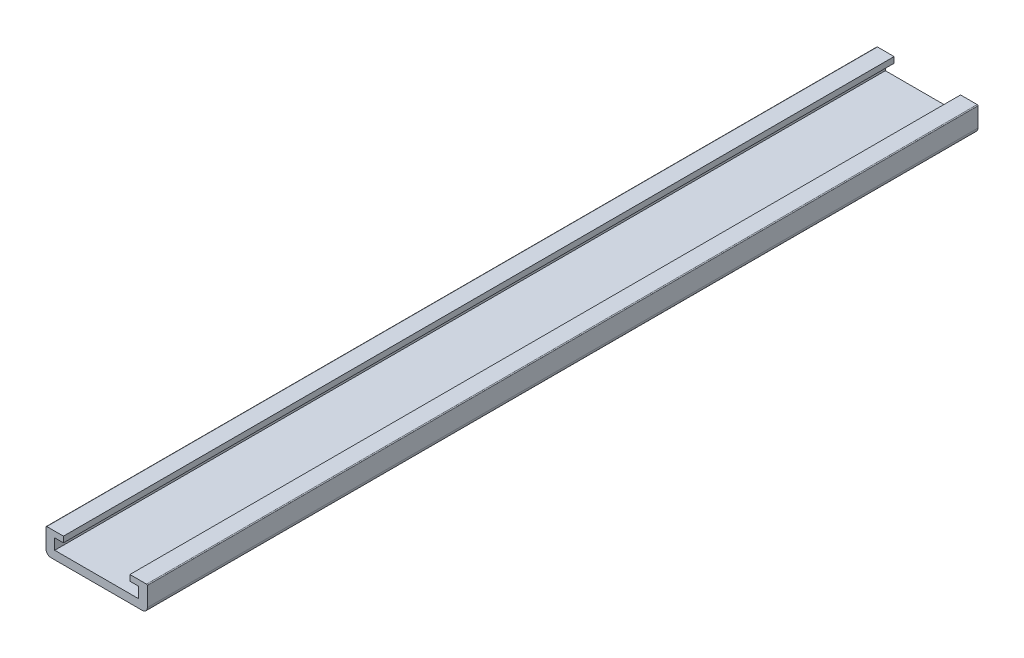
ISO-10303-21;
HEADER;
FILE_DESCRIPTION(('STEP AP214'),'2;1');
FILE_NAME('part.step','',(''),(''),'','','');
FILE_SCHEMA(('AUTOMOTIVE_DESIGN { 1 0 10303 214 1 1 1 1 }'));
ENDSEC;
DATA;
#1=APPLICATION_CONTEXT('core data for automotive mechanical design processes');
#2=APPLICATION_PROTOCOL_DEFINITION('international standard','automotive_design',2000,#1);
#3=PRODUCT_CONTEXT('',#1,'mechanical');
#4=PRODUCT('Part','Part','',(#3));
#5=PRODUCT_RELATED_PRODUCT_CATEGORY('part','',(#4));
#6=PRODUCT_DEFINITION_FORMATION('','',#4);
#7=PRODUCT_DEFINITION_CONTEXT('part definition',#1,'design');
#8=PRODUCT_DEFINITION('design','',#6,#7);
#9=PRODUCT_DEFINITION_SHAPE('','',#8);
#10=(LENGTH_UNIT() NAMED_UNIT(*) SI_UNIT(.MILLI.,.METRE.));
#11=(NAMED_UNIT(*) PLANE_ANGLE_UNIT() SI_UNIT($,.RADIAN.));
#12=(NAMED_UNIT(*) SI_UNIT($,.STERADIAN.) SOLID_ANGLE_UNIT());
#13=UNCERTAINTY_MEASURE_WITH_UNIT(LENGTH_MEASURE(1.E-05),#10,'distance_accuracy_value','');
#14=(GEOMETRIC_REPRESENTATION_CONTEXT(3) GLOBAL_UNCERTAINTY_ASSIGNED_CONTEXT((#13)) GLOBAL_UNIT_ASSIGNED_CONTEXT((#10,
#11,#12)) REPRESENTATION_CONTEXT('',''));
#15=CARTESIAN_POINT('',(0.,0.,0.));
#16=DIRECTION('',(0.,0.,1.));
#17=DIRECTION('',(1.,0.,0.));
#18=AXIS2_PLACEMENT_3D('',#15,#16,#17);
#19=CARTESIAN_POINT('',(-25.25,4.50872170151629,500.));
#20=DIRECTION('',(-1.,0.,0.));
#21=DIRECTION('',(0.,0.,1.));
#22=AXIS2_PLACEMENT_3D('',#19,#20,#21);
#23=PLANE('',#22);
#24=DIRECTION('',(0.,1.,0.));
#25=VECTOR('',#24,1.);
#26=CARTESIAN_POINT('',(-25.25,4.50872170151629,0.));
#27=LINE('',#26,#25);
#28=CARTESIAN_POINT('',(-25.25,4.50872170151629,0.));
#29=VERTEX_POINT('',#28);
#30=CARTESIAN_POINT('',(-25.25,11.0087217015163,0.));
#31=VERTEX_POINT('',#30);
#32=EDGE_CURVE('E158',#29,#31,#27,.T.);
#33=ORIENTED_EDGE('',*,*,#32,.T.);
#34=DIRECTION('',(0.,0.,-1.));
#35=VECTOR('',#34,1.);
#36=CARTESIAN_POINT('',(-25.25,11.0087217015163,500.));
#37=LINE('',#36,#35);
#38=CARTESIAN_POINT('',(-25.25,11.0087217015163,500.));
#39=VERTEX_POINT('',#38);
#40=EDGE_CURVE('E9',#39,#31,#37,.T.);
#41=ORIENTED_EDGE('',*,*,#40,.F.);
#42=DIRECTION('',(0.,1.,0.));
#43=VECTOR('',#42,1.);
#44=CARTESIAN_POINT('',(-25.25,4.50872170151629,500.));
#45=LINE('',#44,#43);
#46=CARTESIAN_POINT('',(-25.25,4.50872170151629,500.));
#47=VERTEX_POINT('',#46);
#48=EDGE_CURVE('E188',#47,#39,#45,.T.);
#49=ORIENTED_EDGE('',*,*,#48,.F.);
#50=DIRECTION('',(0.,0.,-1.));
#51=VECTOR('',#50,1.);
#52=CARTESIAN_POINT('',(-25.25,4.50872170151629,500.));
#53=LINE('',#52,#51);
#54=EDGE_CURVE('E154',#47,#29,#53,.T.);
#55=ORIENTED_EDGE('',*,*,#54,.T.);
#56=EDGE_LOOP('',(#33,#41,#49,#55));
#57=FACE_BOUND('',#56,.T.);
#58=ADVANCED_FACE('F14',(#57),#23,.F.);
#59=CARTESIAN_POINT('',(-25.25,11.0087217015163,500.));
#60=DIRECTION('',(0.,1.,0.));
#61=DIRECTION('',(0.,0.,1.));
#62=AXIS2_PLACEMENT_3D('',#59,#60,#61);
#63=PLANE('',#62);
#64=DIRECTION('',(1.,0.,0.));
#65=VECTOR('',#64,1.);
#66=CARTESIAN_POINT('',(-25.25,11.0087217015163,0.));
#67=LINE('',#66,#65);
#68=CARTESIAN_POINT('',(-20.,11.0087217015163,0.));
#69=VERTEX_POINT('',#68);
#70=EDGE_CURVE('E161',#31,#69,#67,.T.);
#71=ORIENTED_EDGE('',*,*,#70,.T.);
#72=DIRECTION('',(0.,0.,-1.));
#73=VECTOR('',#72,1.);
#74=CARTESIAN_POINT('',(-20.,11.0087217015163,500.));
#75=LINE('',#74,#73);
#76=CARTESIAN_POINT('',(-20.,11.0087217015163,500.));
#77=VERTEX_POINT('',#76);
#78=EDGE_CURVE('E22',#77,#69,#75,.T.);
#79=ORIENTED_EDGE('',*,*,#78,.F.);
#80=DIRECTION('',(1.,0.,0.));
#81=VECTOR('',#80,1.);
#82=CARTESIAN_POINT('',(-25.25,11.0087217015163,500.));
#83=LINE('',#82,#81);
#84=EDGE_CURVE('E97',#39,#77,#83,.T.);
#85=ORIENTED_EDGE('',*,*,#84,.F.);
#86=ORIENTED_EDGE('',*,*,#40,.T.);
#87=EDGE_LOOP('',(#71,#79,#85,#86));
#88=FACE_BOUND('',#87,.T.);
#89=ADVANCED_FACE('F287',(#88),#63,.F.);
#90=CARTESIAN_POINT('',(-20.,14.5087217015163,500.));
#91=DIRECTION('',(-1.,0.,0.));
#92=DIRECTION('',(0.,0.,1.));
#93=AXIS2_PLACEMENT_3D('',#90,#91,#92);
#94=PLANE('',#93);
#95=DIRECTION('',(0.,1.,0.));
#96=VECTOR('',#95,1.);
#97=CARTESIAN_POINT('',(-20.,14.5087217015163,0.));
#98=LINE('',#97,#96);
#99=CARTESIAN_POINT('',(-20.,14.5087217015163,0.));
#100=VERTEX_POINT('',#99);
#101=EDGE_CURVE('E163',#69,#100,#98,.T.);
#102=ORIENTED_EDGE('',*,*,#101,.T.);
#103=DIRECTION('',(0.,0.,-1.));
#104=VECTOR('',#103,1.);
#105=CARTESIAN_POINT('',(-20.,14.5087217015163,500.));
#106=LINE('',#105,#104);
#107=CARTESIAN_POINT('',(-20.,14.5087217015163,500.));
#108=VERTEX_POINT('',#107);
#109=EDGE_CURVE('E219',#108,#100,#106,.T.);
#110=ORIENTED_EDGE('',*,*,#109,.F.);
#111=DIRECTION('',(0.,1.,0.));
#112=VECTOR('',#111,1.);
#113=CARTESIAN_POINT('',(-20.,14.5087217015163,500.));
#114=LINE('',#113,#112);
#115=EDGE_CURVE('E227',#77,#108,#114,.T.);
#116=ORIENTED_EDGE('',*,*,#115,.F.);
#117=ORIENTED_EDGE('',*,*,#78,.T.);
#118=EDGE_LOOP('',(#102,#110,#116,#117));
#119=FACE_BOUND('',#118,.T.);
#120=ADVANCED_FACE('F225',(#119),#94,.F.);
#121=CARTESIAN_POINT('',(-30.,14.5087217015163,500.));
#122=DIRECTION('',(0.,-1.,0.));
#123=DIRECTION('',(0.,0.,-1.));
#124=AXIS2_PLACEMENT_3D('',#121,#122,#123);
#125=PLANE('',#124);
#126=DIRECTION('',(-1.,0.,0.));
#127=VECTOR('',#126,1.);
#128=CARTESIAN_POINT('',(-30.,14.5087217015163,0.));
#129=LINE('',#128,#127);
#130=CARTESIAN_POINT('',(-30.,14.5087217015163,0.));
#131=VERTEX_POINT('',#130);
#132=EDGE_CURVE('E165',#100,#131,#129,.T.);
#133=ORIENTED_EDGE('',*,*,#132,.T.);
#134=DIRECTION('',(0.,0.,-1.));
#135=VECTOR('',#134,1.);
#136=CARTESIAN_POINT('',(-30.,14.5087217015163,500.));
#137=LINE('',#136,#135);
#138=CARTESIAN_POINT('',(-30.,14.5087217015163,500.));
#139=VERTEX_POINT('',#138);
#140=EDGE_CURVE('E216',#139,#131,#137,.T.);
#141=ORIENTED_EDGE('',*,*,#140,.F.);
#142=DIRECTION('',(-1.,0.,0.));
#143=VECTOR('',#142,1.);
#144=CARTESIAN_POINT('',(-30.,14.5087217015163,500.));
#145=LINE('',#144,#143);
#146=EDGE_CURVE('E245',#108,#139,#145,.T.);
#147=ORIENTED_EDGE('',*,*,#146,.F.);
#148=ORIENTED_EDGE('',*,*,#109,.T.);
#149=EDGE_LOOP('',(#133,#141,#147,#148));
#150=FACE_BOUND('',#149,.T.);
#151=ADVANCED_FACE('F236',(#150),#125,.F.);
#152=CARTESIAN_POINT('',(-30.,14.0087217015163,500.));
#153=DIRECTION('',(0.,0.,-1.));
#154=DIRECTION('',(-1.,0.,0.));
#155=AXIS2_PLACEMENT_3D('',#152,#153,#154);
#156=CYLINDRICAL_SURFACE('',#155,0.5);
#157=CARTESIAN_POINT('',(-30.,14.0087217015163,0.));
#158=DIRECTION('',(0.,0.,1.));
#159=DIRECTION('',(-1.,0.,0.));
#160=AXIS2_PLACEMENT_3D('',#157,#158,#159);
#161=CIRCLE('',#160,0.5);
#162=CARTESIAN_POINT('',(-30.5,14.0087217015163,0.));
#163=VERTEX_POINT('',#162);
#164=EDGE_CURVE('E167',#131,#163,#161,.T.);
#165=ORIENTED_EDGE('',*,*,#164,.T.);
#166=DIRECTION('',(0.,0.,-1.));
#167=VECTOR('',#166,1.);
#168=CARTESIAN_POINT('',(-30.5,14.0087217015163,500.));
#169=LINE('',#168,#167);
#170=CARTESIAN_POINT('',(-30.5,14.0087217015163,500.));
#171=VERTEX_POINT('',#170);
#172=EDGE_CURVE('E213',#171,#163,#169,.T.);
#173=ORIENTED_EDGE('',*,*,#172,.F.);
#174=CARTESIAN_POINT('',(-30.,14.0087217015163,500.));
#175=DIRECTION('',(0.,0.,1.));
#176=DIRECTION('',(-1.,0.,0.));
#177=AXIS2_PLACEMENT_3D('',#174,#175,#176);
#178=CIRCLE('',#177,0.5);
#179=EDGE_CURVE('E242',#139,#171,#178,.T.);
#180=ORIENTED_EDGE('',*,*,#179,.F.);
#181=ORIENTED_EDGE('',*,*,#140,.T.);
#182=EDGE_LOOP('',(#165,#173,#180,#181));
#183=FACE_BOUND('',#182,.T.);
#184=ADVANCED_FACE('F240',(#183),#156,.T.);
#185=CARTESIAN_POINT('',(-30.5,2.50872170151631,500.));
#186=DIRECTION('',(1.,0.,0.));
#187=DIRECTION('',(0.,0.,-1.));
#188=AXIS2_PLACEMENT_3D('',#185,#186,#187);
#189=PLANE('',#188);
#190=DIRECTION('',(0.,-1.,0.));
#191=VECTOR('',#190,1.);
#192=CARTESIAN_POINT('',(-30.5,2.50872170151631,0.));
#193=LINE('',#192,#191);
#194=CARTESIAN_POINT('',(-30.5,2.50872170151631,0.));
#195=VERTEX_POINT('',#194);
#196=EDGE_CURVE('E169',#163,#195,#193,.T.);
#197=ORIENTED_EDGE('',*,*,#196,.T.);
#198=DIRECTION('',(0.,0.,-1.));
#199=VECTOR('',#198,1.);
#200=CARTESIAN_POINT('',(-30.5,2.50872170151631,500.));
#201=LINE('',#200,#199);
#202=CARTESIAN_POINT('',(-30.5,2.50872170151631,500.));
#203=VERTEX_POINT('',#202);
#204=EDGE_CURVE('E210',#203,#195,#201,.T.);
#205=ORIENTED_EDGE('',*,*,#204,.F.);
#206=DIRECTION('',(0.,-1.,0.));
#207=VECTOR('',#206,1.);
#208=CARTESIAN_POINT('',(-30.5,2.50872170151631,500.));
#209=LINE('',#208,#207);
#210=EDGE_CURVE('E244',#171,#203,#209,.T.);
#211=ORIENTED_EDGE('',*,*,#210,.F.);
#212=ORIENTED_EDGE('',*,*,#172,.T.);
#213=EDGE_LOOP('',(#197,#205,#211,#212));
#214=FACE_BOUND('',#213,.T.);
#215=ADVANCED_FACE('F300',(#214),#189,.F.);
#216=CARTESIAN_POINT('',(-27.5,2.50872170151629,500.));
#217=DIRECTION('',(0.,0.,-1.));
#218=DIRECTION('',(-1.,0.,0.));
#219=AXIS2_PLACEMENT_3D('',#216,#217,#218);
#220=CYLINDRICAL_SURFACE('',#219,3.);
#221=CARTESIAN_POINT('',(-27.5,2.50872170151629,0.));
#222=DIRECTION('',(0.,0.,1.));
#223=DIRECTION('',(1.,0.,0.));
#224=AXIS2_PLACEMENT_3D('',#221,#222,#223);
#225=CIRCLE('',#224,3.);
#226=CARTESIAN_POINT('',(-27.5,-0.491278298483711,0.));
#227=VERTEX_POINT('',#226);
#228=EDGE_CURVE('E171',#195,#227,#225,.T.);
#229=ORIENTED_EDGE('',*,*,#228,.T.);
#230=DIRECTION('',(0.,0.,-1.));
#231=VECTOR('',#230,1.);
#232=CARTESIAN_POINT('',(-27.5,-0.491278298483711,500.));
#233=LINE('',#232,#231);
#234=CARTESIAN_POINT('',(-27.5,-0.491278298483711,500.));
#235=VERTEX_POINT('',#234);
#236=EDGE_CURVE('E207',#235,#227,#233,.T.);
#237=ORIENTED_EDGE('',*,*,#236,.F.);
#238=CARTESIAN_POINT('',(-27.5,2.50872170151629,500.));
#239=DIRECTION('',(0.,0.,1.));
#240=DIRECTION('',(1.,0.,0.));
#241=AXIS2_PLACEMENT_3D('',#238,#239,#240);
#242=CIRCLE('',#241,3.);
#243=EDGE_CURVE('E247',#203,#235,#242,.T.);
#244=ORIENTED_EDGE('',*,*,#243,.F.);
#245=ORIENTED_EDGE('',*,*,#204,.T.);
#246=EDGE_LOOP('',(#229,#237,#244,#245));
#247=FACE_BOUND('',#246,.T.);
#248=ADVANCED_FACE('F303',(#247),#220,.T.);
#249=CARTESIAN_POINT('',(-27.5,-0.491278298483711,500.));
#250=DIRECTION('',(0.,1.,0.));
#251=DIRECTION('',(0.,0.,1.));
#252=AXIS2_PLACEMENT_3D('',#249,#250,#251);
#253=PLANE('',#252);
#254=DIRECTION('',(1.,0.,0.));
#255=VECTOR('',#254,1.);
#256=CARTESIAN_POINT('',(-27.5,-0.491278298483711,0.));
#257=LINE('',#256,#255);
#258=CARTESIAN_POINT('',(27.5,-0.491278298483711,0.));
#259=VERTEX_POINT('',#258);
#260=EDGE_CURVE('E173',#227,#259,#257,.T.);
#261=ORIENTED_EDGE('',*,*,#260,.T.);
#262=DIRECTION('',(0.,0.,-1.));
#263=VECTOR('',#262,1.);
#264=CARTESIAN_POINT('',(27.5,-0.491278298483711,500.));
#265=LINE('',#264,#263);
#266=CARTESIAN_POINT('',(27.5,-0.491278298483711,500.));
#267=VERTEX_POINT('',#266);
#268=EDGE_CURVE('E204',#267,#259,#265,.T.);
#269=ORIENTED_EDGE('',*,*,#268,.F.);
#270=DIRECTION('',(1.,0.,0.));
#271=VECTOR('',#270,1.);
#272=CARTESIAN_POINT('',(-27.5,-0.491278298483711,500.));
#273=LINE('',#272,#271);
#274=EDGE_CURVE('E253',#235,#267,#273,.T.);
#275=ORIENTED_EDGE('',*,*,#274,.F.);
#276=ORIENTED_EDGE('',*,*,#236,.T.);
#277=EDGE_LOOP('',(#261,#269,#275,#276));
#278=FACE_BOUND('',#277,.T.);
#279=ADVANCED_FACE('F307',(#278),#253,.F.);
#280=CARTESIAN_POINT('',(27.5,2.50872170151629,500.));
#281=DIRECTION('',(0.,0.,-1.));
#282=DIRECTION('',(-1.,0.,0.));
#283=AXIS2_PLACEMENT_3D('',#280,#281,#282);
#284=CYLINDRICAL_SURFACE('',#283,3.);
#285=CARTESIAN_POINT('',(27.5,2.50872170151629,0.));
#286=DIRECTION('',(0.,0.,1.));
#287=DIRECTION('',(-1.,0.,0.));
#288=AXIS2_PLACEMENT_3D('',#285,#286,#287);
#289=CIRCLE('',#288,3.);
#290=CARTESIAN_POINT('',(30.5,2.50872170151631,0.));
#291=VERTEX_POINT('',#290);
#292=EDGE_CURVE('E175',#259,#291,#289,.T.);
#293=ORIENTED_EDGE('',*,*,#292,.T.);
#294=DIRECTION('',(0.,0.,-1.));
#295=VECTOR('',#294,1.);
#296=CARTESIAN_POINT('',(30.5,2.50872170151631,500.));
#297=LINE('',#296,#295);
#298=CARTESIAN_POINT('',(30.5,2.50872170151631,500.));
#299=VERTEX_POINT('',#298);
#300=EDGE_CURVE('E201',#299,#291,#297,.T.);
#301=ORIENTED_EDGE('',*,*,#300,.F.);
#302=CARTESIAN_POINT('',(27.5,2.50872170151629,500.));
#303=DIRECTION('',(0.,0.,1.));
#304=DIRECTION('',(-1.,0.,0.));
#305=AXIS2_PLACEMENT_3D('',#302,#303,#304);
#306=CIRCLE('',#305,3.);
#307=EDGE_CURVE('E255',#267,#299,#306,.T.);
#308=ORIENTED_EDGE('',*,*,#307,.F.);
#309=ORIENTED_EDGE('',*,*,#268,.T.);
#310=EDGE_LOOP('',(#293,#301,#308,#309));
#311=FACE_BOUND('',#310,.T.);
#312=ADVANCED_FACE('F311',(#311),#284,.T.);
#313=CARTESIAN_POINT('',(30.5,2.50872170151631,500.));
#314=DIRECTION('',(-1.,0.,0.));
#315=DIRECTION('',(0.,-1.,0.));
#316=AXIS2_PLACEMENT_3D('',#313,#314,#315);
#317=PLANE('',#316);
#318=DIRECTION('',(0.,1.,0.));
#319=VECTOR('',#318,1.);
#320=CARTESIAN_POINT('',(30.5,2.50872170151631,0.));
#321=LINE('',#320,#319);
#322=CARTESIAN_POINT('',(30.5,14.0087217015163,0.));
#323=VERTEX_POINT('',#322);
#324=EDGE_CURVE('E177',#291,#323,#321,.T.);
#325=ORIENTED_EDGE('',*,*,#324,.T.);
#326=DIRECTION('',(0.,0.,-1.));
#327=VECTOR('',#326,1.);
#328=CARTESIAN_POINT('',(30.5,14.0087217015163,500.));
#329=LINE('',#328,#327);
#330=CARTESIAN_POINT('',(30.5,14.0087217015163,500.));
#331=VERTEX_POINT('',#330);
#332=EDGE_CURVE('E198',#331,#323,#329,.T.);
#333=ORIENTED_EDGE('',*,*,#332,.F.);
#334=DIRECTION('',(0.,1.,0.));
#335=VECTOR('',#334,1.);
#336=CARTESIAN_POINT('',(30.5,2.50872170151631,500.));
#337=LINE('',#336,#335);
#338=EDGE_CURVE('E257',#299,#331,#337,.T.);
#339=ORIENTED_EDGE('',*,*,#338,.F.);
#340=ORIENTED_EDGE('',*,*,#300,.T.);
#341=EDGE_LOOP('',(#325,#333,#339,#340));
#342=FACE_BOUND('',#341,.T.);
#343=ADVANCED_FACE('F315',(#342),#317,.F.);
#344=CARTESIAN_POINT('',(30.,14.0087217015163,500.));
#345=DIRECTION('',(0.,0.,-1.));
#346=DIRECTION('',(-1.,0.,0.));
#347=AXIS2_PLACEMENT_3D('',#344,#345,#346);
#348=CYLINDRICAL_SURFACE('',#347,0.5);
#349=CARTESIAN_POINT('',(30.,14.0087217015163,0.));
#350=DIRECTION('',(0.,0.,1.));
#351=DIRECTION('',(1.,0.,0.));
#352=AXIS2_PLACEMENT_3D('',#349,#350,#351);
#353=CIRCLE('',#352,0.5);
#354=CARTESIAN_POINT('',(30.,14.5087217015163,0.));
#355=VERTEX_POINT('',#354);
#356=EDGE_CURVE('E179',#323,#355,#353,.T.);
#357=ORIENTED_EDGE('',*,*,#356,.T.);
#358=DIRECTION('',(0.,0.,-1.));
#359=VECTOR('',#358,1.);
#360=CARTESIAN_POINT('',(30.,14.5087217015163,500.));
#361=LINE('',#360,#359);
#362=CARTESIAN_POINT('',(30.,14.5087217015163,500.));
#363=VERTEX_POINT('',#362);
#364=EDGE_CURVE('E195',#363,#355,#361,.T.);
#365=ORIENTED_EDGE('',*,*,#364,.F.);
#366=CARTESIAN_POINT('',(30.,14.0087217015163,500.));
#367=DIRECTION('',(0.,0.,1.));
#368=DIRECTION('',(1.,0.,0.));
#369=AXIS2_PLACEMENT_3D('',#366,#367,#368);
#370=CIRCLE('',#369,0.5);
#371=EDGE_CURVE('E259',#331,#363,#370,.T.);
#372=ORIENTED_EDGE('',*,*,#371,.F.);
#373=ORIENTED_EDGE('',*,*,#332,.T.);
#374=EDGE_LOOP('',(#357,#365,#372,#373));
#375=FACE_BOUND('',#374,.T.);
#376=ADVANCED_FACE('F319',(#375),#348,.T.);
#377=CARTESIAN_POINT('',(20.,14.5087217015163,500.));
#378=DIRECTION('',(0.,-1.,0.));
#379=DIRECTION('',(0.,0.,-1.));
#380=AXIS2_PLACEMENT_3D('',#377,#378,#379);
#381=PLANE('',#380);
#382=DIRECTION('',(-1.,0.,0.));
#383=VECTOR('',#382,1.);
#384=CARTESIAN_POINT('',(20.,14.5087217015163,0.));
#385=LINE('',#384,#383);
#386=CARTESIAN_POINT('',(20.,14.5087217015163,0.));
#387=VERTEX_POINT('',#386);
#388=EDGE_CURVE('E181',#355,#387,#385,.T.);
#389=ORIENTED_EDGE('',*,*,#388,.T.);
#390=DIRECTION('',(0.,0.,-1.));
#391=VECTOR('',#390,1.);
#392=CARTESIAN_POINT('',(20.,14.5087217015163,500.));
#393=LINE('',#392,#391);
#394=CARTESIAN_POINT('',(20.,14.5087217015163,500.));
#395=VERTEX_POINT('',#394);
#396=EDGE_CURVE('E192',#395,#387,#393,.T.);
#397=ORIENTED_EDGE('',*,*,#396,.F.);
#398=DIRECTION('',(-1.,0.,0.));
#399=VECTOR('',#398,1.);
#400=CARTESIAN_POINT('',(20.,14.5087217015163,500.));
#401=LINE('',#400,#399);
#402=EDGE_CURVE('E261',#363,#395,#401,.T.);
#403=ORIENTED_EDGE('',*,*,#402,.F.);
#404=ORIENTED_EDGE('',*,*,#364,.T.);
#405=EDGE_LOOP('',(#389,#397,#403,#404));
#406=FACE_BOUND('',#405,.T.);
#407=ADVANCED_FACE('F267',(#406),#381,.F.);
#408=CARTESIAN_POINT('',(20.,14.5087217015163,500.));
#409=DIRECTION('',(1.,0.,0.));
#410=DIRECTION('',(0.,0.,-1.));
#411=AXIS2_PLACEMENT_3D('',#408,#409,#410);
#412=PLANE('',#411);
#413=DIRECTION('',(0.,-1.,0.));
#414=VECTOR('',#413,1.);
#415=CARTESIAN_POINT('',(20.,14.5087217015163,0.));
#416=LINE('',#415,#414);
#417=CARTESIAN_POINT('',(20.,11.0087217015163,0.));
#418=VERTEX_POINT('',#417);
#419=EDGE_CURVE('E183',#387,#418,#416,.T.);
#420=ORIENTED_EDGE('',*,*,#419,.T.);
#421=DIRECTION('',(0.,0.,-1.));
#422=VECTOR('',#421,1.);
#423=CARTESIAN_POINT('',(20.,11.0087217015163,500.));
#424=LINE('',#423,#422);
#425=CARTESIAN_POINT('',(20.,11.0087217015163,500.));
#426=VERTEX_POINT('',#425);
#427=EDGE_CURVE('E149',#426,#418,#424,.T.);
#428=ORIENTED_EDGE('',*,*,#427,.F.);
#429=DIRECTION('',(0.,-1.,0.));
#430=VECTOR('',#429,1.);
#431=CARTESIAN_POINT('',(20.,14.5087217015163,500.));
#432=LINE('',#431,#430);
#433=EDGE_CURVE('E140',#395,#426,#432,.T.);
#434=ORIENTED_EDGE('',*,*,#433,.F.);
#435=ORIENTED_EDGE('',*,*,#396,.T.);
#436=EDGE_LOOP('',(#420,#428,#434,#435));
#437=FACE_BOUND('',#436,.T.);
#438=ADVANCED_FACE('F271',(#437),#412,.F.);
#439=CARTESIAN_POINT('',(20.,11.0087217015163,500.));
#440=DIRECTION('',(0.,1.,0.));
#441=DIRECTION('',(0.,0.,1.));
#442=AXIS2_PLACEMENT_3D('',#439,#440,#441);
#443=PLANE('',#442);
#444=DIRECTION('',(1.,0.,0.));
#445=VECTOR('',#444,1.);
#446=CARTESIAN_POINT('',(20.,11.0087217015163,0.));
#447=LINE('',#446,#445);
#448=CARTESIAN_POINT('',(25.25,11.0087217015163,0.));
#449=VERTEX_POINT('',#448);
#450=EDGE_CURVE('E148',#418,#449,#447,.T.);
#451=ORIENTED_EDGE('',*,*,#450,.T.);
#452=DIRECTION('',(0.,0.,-1.));
#453=VECTOR('',#452,1.);
#454=CARTESIAN_POINT('',(25.25,11.0087217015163,500.));
#455=LINE('',#454,#453);
#456=CARTESIAN_POINT('',(25.25,11.0087217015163,500.));
#457=VERTEX_POINT('',#456);
#458=EDGE_CURVE('E145',#457,#449,#455,.T.);
#459=ORIENTED_EDGE('',*,*,#458,.F.);
#460=DIRECTION('',(1.,0.,0.));
#461=VECTOR('',#460,1.);
#462=CARTESIAN_POINT('',(20.,11.0087217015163,500.));
#463=LINE('',#462,#461);
#464=EDGE_CURVE('E134',#426,#457,#463,.T.);
#465=ORIENTED_EDGE('',*,*,#464,.F.);
#466=ORIENTED_EDGE('',*,*,#427,.T.);
#467=EDGE_LOOP('',(#451,#459,#465,#466));
#468=FACE_BOUND('',#467,.T.);
#469=ADVANCED_FACE('F146',(#468),#443,.F.);
#470=CARTESIAN_POINT('',(25.25,4.50872170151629,500.));
#471=DIRECTION('',(1.,0.,0.));
#472=DIRECTION('',(0.,0.,-1.));
#473=AXIS2_PLACEMENT_3D('',#470,#471,#472);
#474=PLANE('',#473);
#475=DIRECTION('',(0.,-1.,0.));
#476=VECTOR('',#475,1.);
#477=CARTESIAN_POINT('',(25.25,4.50872170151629,0.));
#478=LINE('',#477,#476);
#479=CARTESIAN_POINT('',(25.25,4.50872170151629,0.));
#480=VERTEX_POINT('',#479);
#481=EDGE_CURVE('E83',#449,#480,#478,.T.);
#482=ORIENTED_EDGE('',*,*,#481,.T.);
#483=DIRECTION('',(0.,0.,-1.));
#484=VECTOR('',#483,1.);
#485=CARTESIAN_POINT('',(25.25,4.50872170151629,500.));
#486=LINE('',#485,#484);
#487=CARTESIAN_POINT('',(25.25,4.50872170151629,500.));
#488=VERTEX_POINT('',#487);
#489=EDGE_CURVE('E150',#488,#480,#486,.T.);
#490=ORIENTED_EDGE('',*,*,#489,.F.);
#491=DIRECTION('',(0.,-1.,0.));
#492=VECTOR('',#491,1.);
#493=CARTESIAN_POINT('',(25.25,4.50872170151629,500.));
#494=LINE('',#493,#492);
#495=EDGE_CURVE('E138',#457,#488,#494,.T.);
#496=ORIENTED_EDGE('',*,*,#495,.F.);
#497=ORIENTED_EDGE('',*,*,#458,.T.);
#498=EDGE_LOOP('',(#482,#490,#496,#497));
#499=FACE_BOUND('',#498,.T.);
#500=ADVANCED_FACE('F152',(#499),#474,.F.);
#501=CARTESIAN_POINT('',(-25.25,4.50872170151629,500.));
#502=DIRECTION('',(0.,-1.,0.));
#503=DIRECTION('',(0.,0.,-1.));
#504=AXIS2_PLACEMENT_3D('',#501,#502,#503);
#505=PLANE('',#504);
#506=DIRECTION('',(-1.,0.,0.));
#507=VECTOR('',#506,1.);
#508=CARTESIAN_POINT('',(-25.25,4.50872170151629,0.));
#509=LINE('',#508,#507);
#510=EDGE_CURVE('E89',#480,#29,#509,.T.);
#511=ORIENTED_EDGE('',*,*,#510,.T.);
#512=ORIENTED_EDGE('',*,*,#54,.F.);
#513=DIRECTION('',(-1.,0.,0.));
#514=VECTOR('',#513,1.);
#515=CARTESIAN_POINT('',(-25.25,4.50872170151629,500.));
#516=LINE('',#515,#514);
#517=EDGE_CURVE('E30',#488,#47,#516,.T.);
#518=ORIENTED_EDGE('',*,*,#517,.F.);
#519=ORIENTED_EDGE('',*,*,#489,.T.);
#520=EDGE_LOOP('',(#511,#512,#518,#519));
#521=FACE_BOUND('',#520,.T.);
#522=ADVANCED_FACE('F275',(#521),#505,.F.);
#523=CARTESIAN_POINT('',(-30.,14.0087217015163,500.));
#524=DIRECTION('',(0.,0.,-1.));
#525=DIRECTION('',(-1.,0.,0.));
#526=AXIS2_PLACEMENT_3D('',#523,#524,#525);
#527=PLANE('',#526);
#528=ORIENTED_EDGE('',*,*,#48,.T.);
#529=ORIENTED_EDGE('',*,*,#84,.T.);
#530=ORIENTED_EDGE('',*,*,#115,.T.);
#531=ORIENTED_EDGE('',*,*,#146,.T.);
#532=ORIENTED_EDGE('',*,*,#179,.T.);
#533=ORIENTED_EDGE('',*,*,#210,.T.);
#534=ORIENTED_EDGE('',*,*,#243,.T.);
#535=ORIENTED_EDGE('',*,*,#274,.T.);
#536=ORIENTED_EDGE('',*,*,#307,.T.);
#537=ORIENTED_EDGE('',*,*,#338,.T.);
#538=ORIENTED_EDGE('',*,*,#371,.T.);
#539=ORIENTED_EDGE('',*,*,#402,.T.);
#540=ORIENTED_EDGE('',*,*,#433,.T.);
#541=ORIENTED_EDGE('',*,*,#464,.T.);
#542=ORIENTED_EDGE('',*,*,#495,.T.);
#543=ORIENTED_EDGE('',*,*,#517,.T.);
#544=EDGE_LOOP('',(#528,#529,#530,#531,#532,#533,#534,#535,#536,#537,#538,#539,#540,#541,#542,#543));
#545=FACE_BOUND('',#544,.T.);
#546=ADVANCED_FACE('F136',(#545),#527,.F.);
#547=CARTESIAN_POINT('',(-30.,14.0087217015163,0.));
#548=DIRECTION('',(0.,0.,-1.));
#549=DIRECTION('',(-1.,0.,0.));
#550=AXIS2_PLACEMENT_3D('',#547,#548,#549);
#551=PLANE('',#550);
#552=ORIENTED_EDGE('',*,*,#32,.F.);
#553=ORIENTED_EDGE('',*,*,#510,.F.);
#554=ORIENTED_EDGE('',*,*,#481,.F.);
#555=ORIENTED_EDGE('',*,*,#450,.F.);
#556=ORIENTED_EDGE('',*,*,#419,.F.);
#557=ORIENTED_EDGE('',*,*,#388,.F.);
#558=ORIENTED_EDGE('',*,*,#356,.F.);
#559=ORIENTED_EDGE('',*,*,#324,.F.);
#560=ORIENTED_EDGE('',*,*,#292,.F.);
#561=ORIENTED_EDGE('',*,*,#260,.F.);
#562=ORIENTED_EDGE('',*,*,#228,.F.);
#563=ORIENTED_EDGE('',*,*,#196,.F.);
#564=ORIENTED_EDGE('',*,*,#164,.F.);
#565=ORIENTED_EDGE('',*,*,#132,.F.);
#566=ORIENTED_EDGE('',*,*,#101,.F.);
#567=ORIENTED_EDGE('',*,*,#70,.F.);
#568=EDGE_LOOP('',(#552,#553,#554,#555,#556,#557,#558,#559,#560,#561,#562,#563,#564,#565,#566,#567));
#569=FACE_BOUND('',#568,.T.);
#570=ADVANCED_FACE('F231',(#569),#551,.T.);
#571=CLOSED_SHELL('',(#58,#89,#120,#151,#184,#215,#248,#279,#312,#343,#376,#407,#438,#469,#500,
#522,#546,#570));
#572=MANIFOLD_SOLID_BREP('B1',#571);
#573=ADVANCED_BREP_SHAPE_REPRESENTATION('',(#18,#572),#14);
#574=SHAPE_DEFINITION_REPRESENTATION(#9,#573);
ENDSEC;
END-ISO-10303-21;
